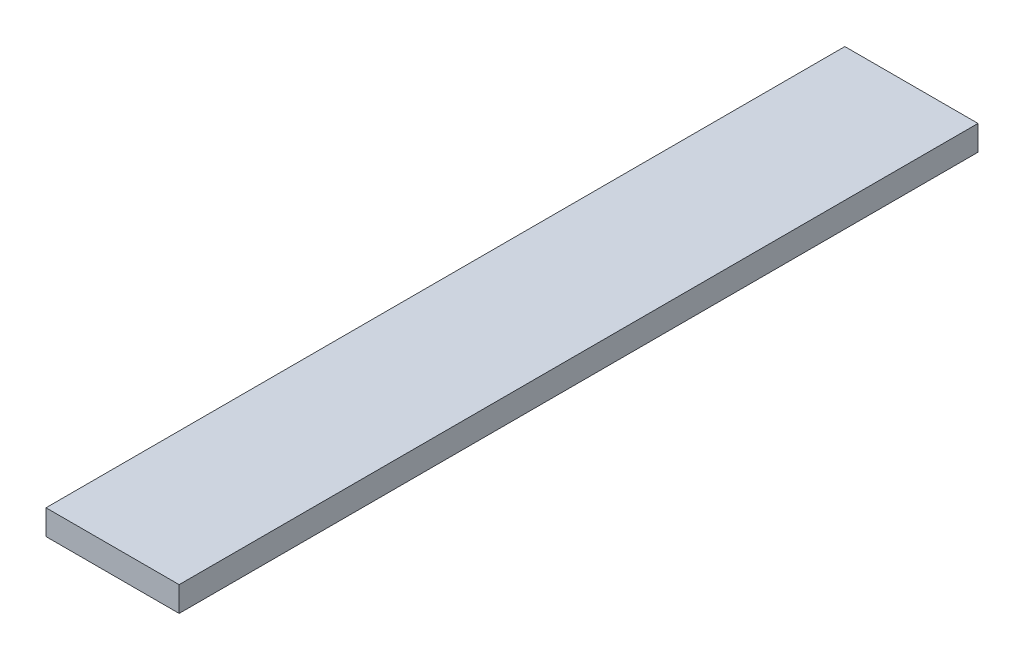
ISO-10303-21;
HEADER;
FILE_DESCRIPTION(('STEP AP214'),'2;1');
FILE_NAME('part.step','',(''),(''),'','','');
FILE_SCHEMA(('AUTOMOTIVE_DESIGN { 1 0 10303 214 1 1 1 1 }'));
ENDSEC;
DATA;
#1=APPLICATION_CONTEXT('core data for automotive mechanical design processes');
#2=APPLICATION_PROTOCOL_DEFINITION('international standard','automotive_design',2000,#1);
#3=PRODUCT_CONTEXT('',#1,'mechanical');
#4=PRODUCT('Part','Part','',(#3));
#5=PRODUCT_RELATED_PRODUCT_CATEGORY('part','',(#4));
#6=PRODUCT_DEFINITION_FORMATION('','',#4);
#7=PRODUCT_DEFINITION_CONTEXT('part definition',#1,'design');
#8=PRODUCT_DEFINITION('design','',#6,#7);
#9=PRODUCT_DEFINITION_SHAPE('','',#8);
#10=(LENGTH_UNIT() NAMED_UNIT(*) SI_UNIT(.MILLI.,.METRE.));
#11=(NAMED_UNIT(*) PLANE_ANGLE_UNIT() SI_UNIT($,.RADIAN.));
#12=(NAMED_UNIT(*) SI_UNIT($,.STERADIAN.) SOLID_ANGLE_UNIT());
#13=UNCERTAINTY_MEASURE_WITH_UNIT(LENGTH_MEASURE(1.E-05),#10,'distance_accuracy_value','');
#14=(GEOMETRIC_REPRESENTATION_CONTEXT(3) GLOBAL_UNCERTAINTY_ASSIGNED_CONTEXT((#13)) GLOBAL_UNIT_ASSIGNED_CONTEXT((#10,
#11,#12)) REPRESENTATION_CONTEXT('',''));
#15=CARTESIAN_POINT('',(0.,0.,0.));
#16=DIRECTION('',(0.,0.,1.));
#17=DIRECTION('',(1.,0.,0.));
#18=AXIS2_PLACEMENT_3D('',#15,#16,#17);
#19=CARTESIAN_POINT('',(6.35,2.38125,38.1));
#20=DIRECTION('',(-1.,0.,0.));
#21=DIRECTION('',(0.,0.,1.));
#22=AXIS2_PLACEMENT_3D('',#19,#20,#21);
#23=PLANE('',#22);
#24=DIRECTION('',(0.,0.,-1.));
#25=VECTOR('',#24,1.);
#26=CARTESIAN_POINT('',(6.35,0.,38.1));
#27=LINE('',#26,#25);
#28=CARTESIAN_POINT('',(6.35,0.,38.1));
#29=VERTEX_POINT('',#28);
#30=CARTESIAN_POINT('',(6.35,0.,-38.1));
#31=VERTEX_POINT('',#30);
#32=EDGE_CURVE('E96',#29,#31,#27,.T.);
#33=ORIENTED_EDGE('',*,*,#32,.T.);
#34=DIRECTION('',(0.,-1.,0.));
#35=VECTOR('',#34,1.);
#36=CARTESIAN_POINT('',(6.35,2.38125,-38.1));
#37=LINE('',#36,#35);
#38=CARTESIAN_POINT('',(6.35,2.38125,-38.1));
#39=VERTEX_POINT('',#38);
#40=EDGE_CURVE('E11',#39,#31,#37,.T.);
#41=ORIENTED_EDGE('',*,*,#40,.F.);
#42=DIRECTION('',(0.,0.,-1.));
#43=VECTOR('',#42,1.);
#44=CARTESIAN_POINT('',(6.35,2.38125,38.1));
#45=LINE('',#44,#43);
#46=CARTESIAN_POINT('',(6.35,2.38125,38.1));
#47=VERTEX_POINT('',#46);
#48=EDGE_CURVE('E84',#47,#39,#45,.T.);
#49=ORIENTED_EDGE('',*,*,#48,.F.);
#50=DIRECTION('',(0.,-1.,0.));
#51=VECTOR('',#50,1.);
#52=CARTESIAN_POINT('',(6.35,2.38125,38.1));
#53=LINE('',#52,#51);
#54=EDGE_CURVE('E92',#47,#29,#53,.T.);
#55=ORIENTED_EDGE('',*,*,#54,.T.);
#56=EDGE_LOOP('',(#33,#41,#49,#55));
#57=FACE_BOUND('',#56,.T.);
#58=ADVANCED_FACE('F33',(#57),#23,.F.);
#59=CARTESIAN_POINT('',(-6.35,2.38125,-38.1));
#60=DIRECTION('',(0.,0.,1.));
#61=DIRECTION('',(1.,0.,0.));
#62=AXIS2_PLACEMENT_3D('',#59,#60,#61);
#63=PLANE('',#62);
#64=DIRECTION('',(-1.,0.,0.));
#65=VECTOR('',#64,1.);
#66=CARTESIAN_POINT('',(-6.35,0.,-38.1));
#67=LINE('',#66,#65);
#68=CARTESIAN_POINT('',(-6.35,0.,-38.1));
#69=VERTEX_POINT('',#68);
#70=EDGE_CURVE('E88',#31,#69,#67,.T.);
#71=ORIENTED_EDGE('',*,*,#70,.T.);
#72=DIRECTION('',(0.,-1.,0.));
#73=VECTOR('',#72,1.);
#74=CARTESIAN_POINT('',(-6.35,2.38125,-38.1));
#75=LINE('',#74,#73);
#76=CARTESIAN_POINT('',(-6.35,2.38125,-38.1));
#77=VERTEX_POINT('',#76);
#78=EDGE_CURVE('E41',#77,#69,#75,.T.);
#79=ORIENTED_EDGE('',*,*,#78,.F.);
#80=DIRECTION('',(-1.,0.,0.));
#81=VECTOR('',#80,1.);
#82=CARTESIAN_POINT('',(-6.35,2.38125,-38.1));
#83=LINE('',#82,#81);
#84=EDGE_CURVE('E79',#39,#77,#83,.T.);
#85=ORIENTED_EDGE('',*,*,#84,.F.);
#86=ORIENTED_EDGE('',*,*,#40,.T.);
#87=EDGE_LOOP('',(#71,#79,#85,#86));
#88=FACE_BOUND('',#87,.T.);
#89=ADVANCED_FACE('F87',(#88),#63,.F.);
#90=CARTESIAN_POINT('',(-6.35,2.38125,38.1));
#91=DIRECTION('',(1.,0.,0.));
#92=DIRECTION('',(0.,0.,-1.));
#93=AXIS2_PLACEMENT_3D('',#90,#91,#92);
#94=PLANE('',#93);
#95=DIRECTION('',(0.,0.,1.));
#96=VECTOR('',#95,1.);
#97=CARTESIAN_POINT('',(-6.35,0.,38.1));
#98=LINE('',#97,#96);
#99=CARTESIAN_POINT('',(-6.35,0.,38.1));
#100=VERTEX_POINT('',#99);
#101=EDGE_CURVE('E66',#69,#100,#98,.T.);
#102=ORIENTED_EDGE('',*,*,#101,.T.);
#103=DIRECTION('',(0.,-1.,0.));
#104=VECTOR('',#103,1.);
#105=CARTESIAN_POINT('',(-6.35,2.38125,38.1));
#106=LINE('',#105,#104);
#107=CARTESIAN_POINT('',(-6.35,2.38125,38.1));
#108=VERTEX_POINT('',#107);
#109=EDGE_CURVE('E89',#108,#100,#106,.T.);
#110=ORIENTED_EDGE('',*,*,#109,.F.);
#111=DIRECTION('',(0.,0.,1.));
#112=VECTOR('',#111,1.);
#113=CARTESIAN_POINT('',(-6.35,2.38125,38.1));
#114=LINE('',#113,#112);
#115=EDGE_CURVE('E82',#77,#108,#114,.T.);
#116=ORIENTED_EDGE('',*,*,#115,.F.);
#117=ORIENTED_EDGE('',*,*,#78,.T.);
#118=EDGE_LOOP('',(#102,#110,#116,#117));
#119=FACE_BOUND('',#118,.T.);
#120=ADVANCED_FACE('F90',(#119),#94,.F.);
#121=CARTESIAN_POINT('',(-6.35,2.38125,38.1));
#122=DIRECTION('',(0.,0.,-1.));
#123=DIRECTION('',(-1.,0.,0.));
#124=AXIS2_PLACEMENT_3D('',#121,#122,#123);
#125=PLANE('',#124);
#126=DIRECTION('',(1.,0.,0.));
#127=VECTOR('',#126,1.);
#128=CARTESIAN_POINT('',(-6.35,0.,38.1));
#129=LINE('',#128,#127);
#130=EDGE_CURVE('E72',#100,#29,#129,.T.);
#131=ORIENTED_EDGE('',*,*,#130,.T.);
#132=ORIENTED_EDGE('',*,*,#54,.F.);
#133=DIRECTION('',(1.,0.,0.));
#134=VECTOR('',#133,1.);
#135=CARTESIAN_POINT('',(-6.35,2.38125,38.1));
#136=LINE('',#135,#134);
#137=EDGE_CURVE('E49',#108,#47,#136,.T.);
#138=ORIENTED_EDGE('',*,*,#137,.F.);
#139=ORIENTED_EDGE('',*,*,#109,.T.);
#140=EDGE_LOOP('',(#131,#132,#138,#139));
#141=FACE_BOUND('',#140,.T.);
#142=ADVANCED_FACE('F103',(#141),#125,.F.);
#143=CARTESIAN_POINT('',(0.,2.38125,0.));
#144=DIRECTION('',(0.,-1.,0.));
#145=DIRECTION('',(0.,0.,-1.));
#146=AXIS2_PLACEMENT_3D('',#143,#144,#145);
#147=PLANE('',#146);
#148=ORIENTED_EDGE('',*,*,#48,.T.);
#149=ORIENTED_EDGE('',*,*,#84,.T.);
#150=ORIENTED_EDGE('',*,*,#115,.T.);
#151=ORIENTED_EDGE('',*,*,#137,.T.);
#152=EDGE_LOOP('',(#148,#149,#150,#151));
#153=FACE_BOUND('',#152,.T.);
#154=ADVANCED_FACE('F80',(#153),#147,.F.);
#155=CARTESIAN_POINT('',(0.,0.,0.));
#156=DIRECTION('',(0.,-1.,0.));
#157=DIRECTION('',(0.,0.,-1.));
#158=AXIS2_PLACEMENT_3D('',#155,#156,#157);
#159=PLANE('',#158);
#160=ORIENTED_EDGE('',*,*,#32,.F.);
#161=ORIENTED_EDGE('',*,*,#130,.F.);
#162=ORIENTED_EDGE('',*,*,#101,.F.);
#163=ORIENTED_EDGE('',*,*,#70,.F.);
#164=EDGE_LOOP('',(#160,#161,#162,#163));
#165=FACE_BOUND('',#164,.T.);
#166=ADVANCED_FACE('F106',(#165),#159,.T.);
#167=CLOSED_SHELL('',(#58,#89,#120,#142,#154,#166));
#168=MANIFOLD_SOLID_BREP('B2',#167);
#169=ADVANCED_BREP_SHAPE_REPRESENTATION('',(#18,#168),#14);
#170=SHAPE_DEFINITION_REPRESENTATION(#9,#169);
ENDSEC;
END-ISO-10303-21;
